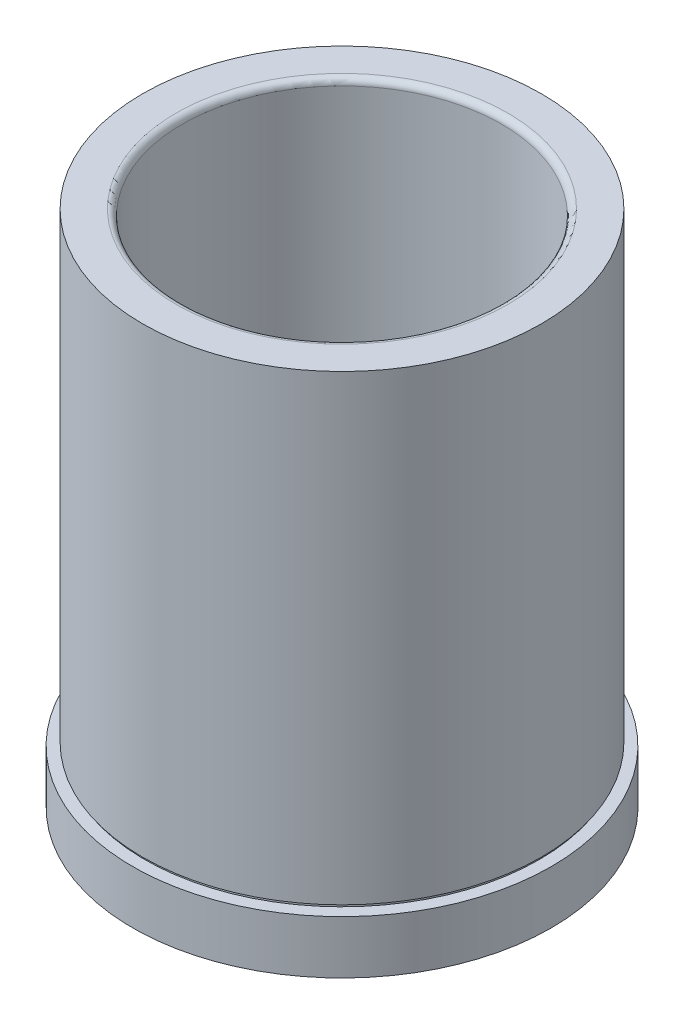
from build123d import *

# Parameters (mm, degrees)
FILLET1_R = 1.524


with BuildPart() as part:
    # Sketch1 → Revolve1 (revolve)
    with BuildSketch(Plane.XY, mode=Mode.PRIVATE) as revolve1_sk:
        Polygon((-38.10635, 139.750690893), (-38.10635, 16.741746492), (-38.922405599, 15.925690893), (-49.9999, 15.925690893), (-49.9999, 28.625690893), (-47.12335, 28.625690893), (-47.12335, 29.387690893), (-47.63135, 29.387690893), (-47.63135, 139.750690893), align=None)
    revolve(revolve1_sk.sketch.rotate(Axis((0, -1000, 0), (0, 1, 0)), 180), axis=Axis((0, -1000, 0), (0, 1, 0)))

    # Fillet1
    fillet1_edges = [part.edges().sort_by_distance(p)[0] for p in [
        (-38.10635, 139.750690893, 0),
    ]]
    fillet(fillet1_edges, radius=FILLET1_R)


solid = part.part
